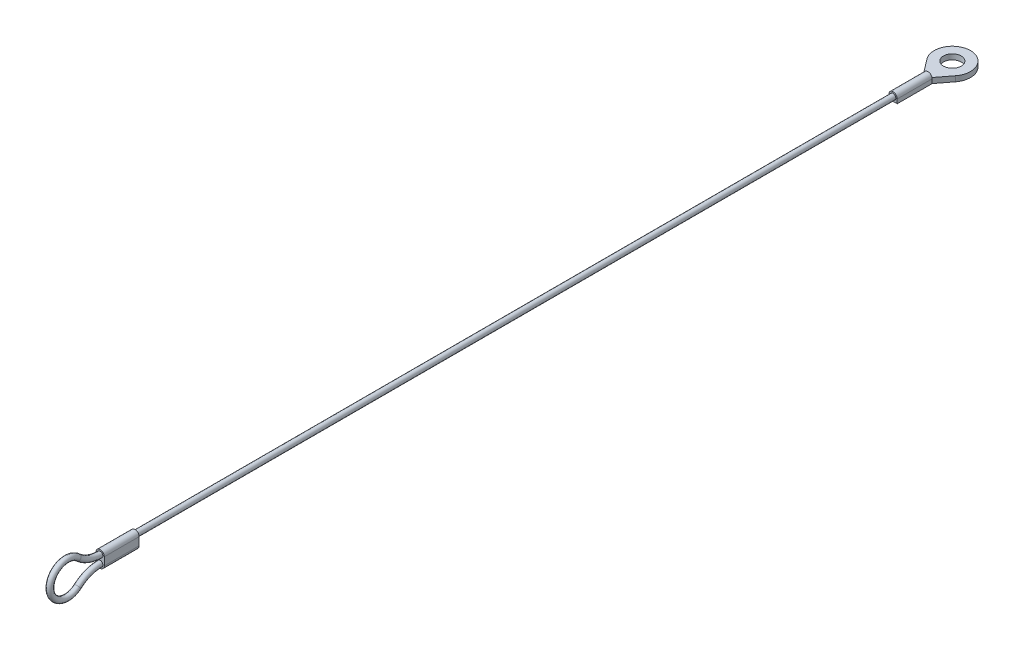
from build123d import *

# Parameters (mm, degrees)
SKETCH2_R           = 0.795
BOSS_EXTRUDE1_DEPTH = 10
BOSS_EXTRUDE2_DEPTH = 10
SKETCH5_R           = 2.54
BOSS_EXTRUDE3_DEPTH = 1.52


with BuildPart() as part:
    # Sweep1: sweep along a path in Sketch1
    with BuildLine(Plane(origin=(0, 0, 0), x_dir=(0, 0, -1), z_dir=(1, 0, 0))) as sweep1_path:
        Line((0, 0), (-227.4, 0))
        ThreePointArc((-227.4, 0), (-230.825492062, 0.631945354), (-233.8, 2.444582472))
        ThreePointArc((-233.8, 2.444582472), (-241.8, -1.133126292), (-233.8, -4.710835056))
        ThreePointArc((-233.8, -4.710835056), (-230.825492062, -2.898197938), (-227.4, -2.266252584))
    # Sketch2 → Sweep1 (sweep)
    with BuildSketch(Plane.XY):
        Circle(SKETCH2_R)
    sweep(path=sweep1_path.line)

    # Sketch3 → Boss-Extrude1 (add)
    with BuildSketch(Plane(origin=(0, 0, 227.4), x_dir=(-1, 0, 0), z_dir=(0, 0, -1))):
        with BuildLine():
            Line((1.195, 0), (1.195, -2.266252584))
            ThreePointArc((1.195, -2.266252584), (0, -3.461252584), (-1.195, -2.266252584))
            Line((-1.195, -2.266252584), (-1.195, 0))
            ThreePointArc((-1.195, 0), (0, 1.195), (1.195, 0))
        make_face()
    extrude(amount=BOSS_EXTRUDE1_DEPTH)

    # Sketch4 → Boss-Extrude2 (add)
    with BuildSketch(Plane(origin=(0, 0, 0), x_dir=(-1, 0, 0), z_dir=(0, 0, -1))):
        with BuildLine():
            Line((-1.195, 0), (-1.195, -1.195))
            Line((-1.195, -1.195), (0, -1.195))
            Line((0, -1.195), (1.195, -1.195))
            Line((1.195, -1.195), (1.195, 0))
            ThreePointArc((1.195, 0), (0, 1.195), (-1.195, 0))
        make_face()
    extrude(amount=BOSS_EXTRUDE2_DEPTH)

    # Sketch5 → Boss-Extrude3 (add)
    with BuildSketch(Plane.XZ.offset(1.195)):
        with BuildLine():
            Line((-1.195, -10), (1.195, -10))
            Line((1.195, -10), (4.132281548, -13.835150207))
            ThreePointArc((4.132281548, -13.835150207), (0, -22.205), (-4.132281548, -13.835150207))
            Line((-4.132281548, -13.835150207), (-1.195, -10))
        make_face()
        with Locations(Location((0, -17, 0), (0, 0, 270))):
            Circle(SKETCH5_R, mode=Mode.SUBTRACT)
    extrude(amount=-BOSS_EXTRUDE3_DEPTH)


solid = part.part
